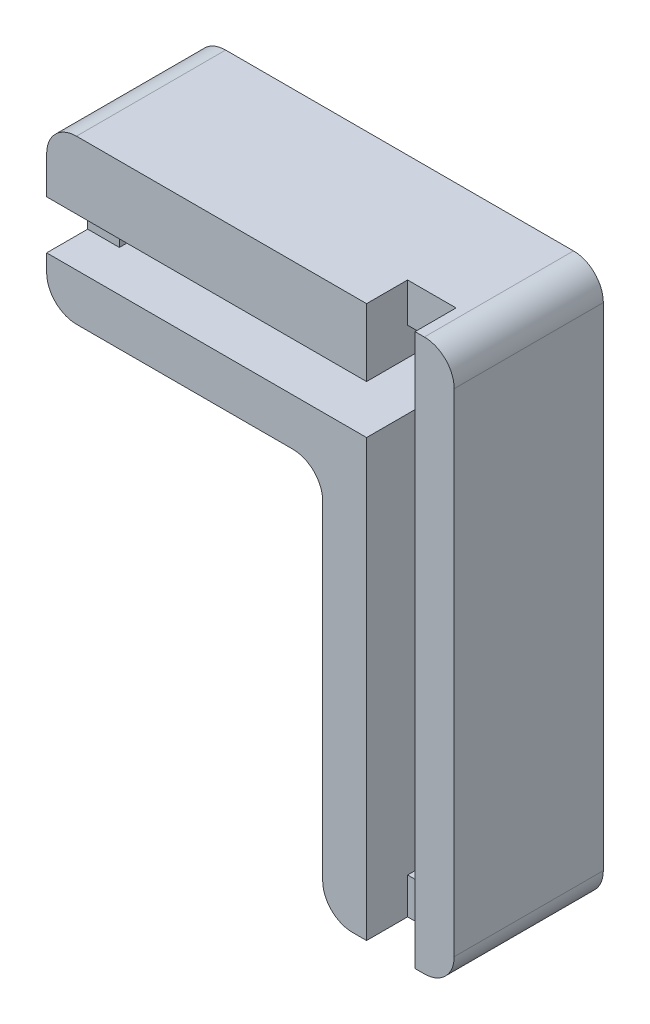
from build123d import *

# Parameters (mm, degrees)
SKETCH1_W           = 54.65
SKETCH1_H           = 73.97
BOSS_EXTRUDE1_DEPTH = 20
SKETCH2_W           = 38.65
SKETCH2_H           = 6.5
SKETCH2_W_2         = 6.5
SKETCH2_H_2         = 63.85
CUT_EXTRUDE1_DEPTH  = 15
SKETCH3_W           = 37.014569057
SKETCH3_H           = 52.121187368
CUT_EXTRUDE2_DEPTH  = 20
SKETCH4_W           = 4.25
SKETCH4_H           = 6.5
SKETCH4_W_2         = 6.5
SKETCH4_H_2         = 5.25
SKETCH4_H_3         = 4.87
CUT_EXTRUDE3_DEPTH  = 5.5
FILLET1_R           = 4


with BuildPart() as part:
    # Sketch1 → Boss-Extrude1 (new body)
    with BuildSketch(Plane.XY):
        with Locations((27.325, 36.985)):
            Rectangle(SKETCH1_W, SKETCH1_H)
    extrude(amount=BOSS_EXTRUDE1_DEPTH)

    # Sketch2 → Cut-Extrude1 (cut)
    with BuildSketch(Plane.XY.offset(20)):
        with Locations((23.575, 61.67)):
            Rectangle(SKETCH2_W, SKETCH2_H)
        with Locations((46.15, 36.795)):
            Rectangle(SKETCH2_W_2, SKETCH2_H_2)
    extrude(amount=-CUT_EXTRUDE1_DEPTH, mode=Mode.SUBTRACT)

    # Sketch3 → Cut-Extrude2 (cut)
    with BuildSketch(Plane.XY.offset(20)):
        with Locations((18.507284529, 26.060593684)):
            Rectangle(SKETCH3_W, SKETCH3_H)
    extrude(amount=-CUT_EXTRUDE2_DEPTH, mode=Mode.SUBTRACT)

    # Sketch4 → Cut-Extrude3 (cut)
    with BuildSketch(Plane.XY.offset(20)):
        with Locations((2.125, 61.67)):
            Rectangle(SKETCH4_W, SKETCH4_H)
        with Locations((46.15, 71.345)):
            Rectangle(SKETCH4_W_2, SKETCH4_H_2)
        with Locations((46.15, 2.435)):
            Rectangle(SKETCH4_W_2, SKETCH4_H_3)
    extrude(amount=-CUT_EXTRUDE3_DEPTH, mode=Mode.SUBTRACT)

    # Fillet1
    fillet1_edges = [part.edges().sort_by_distance(p)[0] for p in [
        (0, 52.121187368, 10),
        (37.014569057, 52.121187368, 10),
        (37.014569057, 0, 10),
        (0, 73.97, 10),
        (54.65, 73.97, 10),
        (54.65, 0, 10),
    ]]
    fillet(fillet1_edges, radius=FILLET1_R)


solid = part.part
